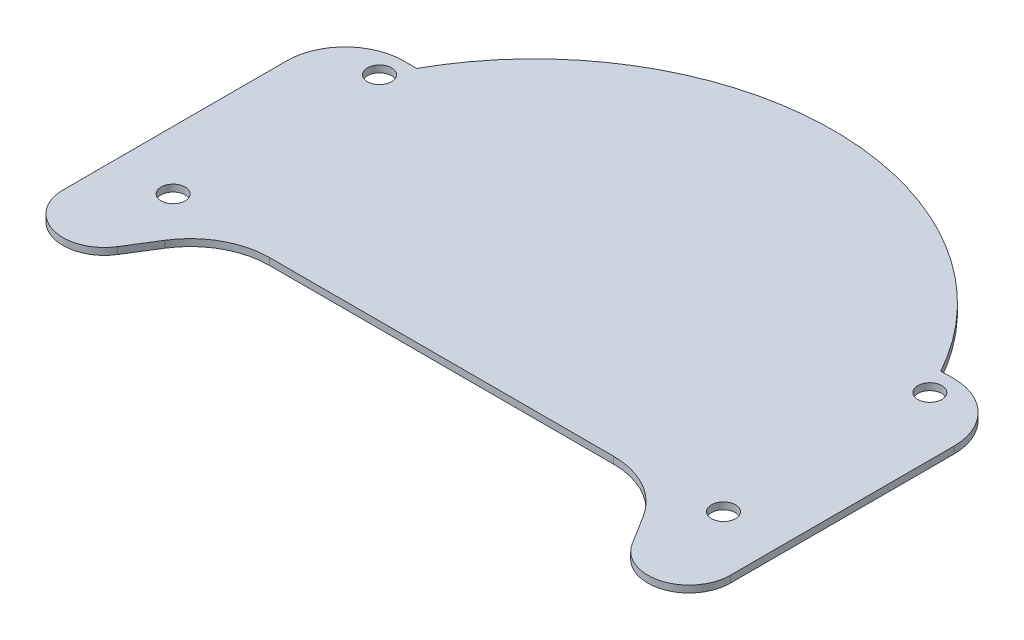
from build123d import *

# Parameters (mm, degrees)
CROQUIS9_R              = 3.5
SALIENTE_EXTRUIR1_DEPTH = 2


with BuildPart() as part:
    # Croquis9 → Saliente-Extruir1 (new body)
    with BuildSketch(Plane(origin=(0, 0, 0), x_dir=(1, 0, 0), z_dir=(0, 1, 0))):
        with BuildLine():
            Line((80, 72), (76.190550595, 72))
            ThreePointArc((76.190550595, 72), (0, 117), (-76.190550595, 72))
            Line((-76.190550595, 72), (-80, 72))
            ThreePointArc((-80, 72), (-92.02081528, 67.02081528), (-97, 55))
            Line((-97, 55), (-97, -10))
            ThreePointArc((-97, -10), (-88.296653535, -21.538287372), (-74.811320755, -16.339622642))
            Line((-74.811320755, -16.339622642), (-69.528301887, -7.849056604))
            ThreePointArc((-69.528301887, -7.849056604), (-61.169787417, 0.105617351), (-50, 3))
            Line((-50, 3), (50, 3))
            ThreePointArc((50, 3), (61.169787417, 0.105617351), (69.528301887, -7.849056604))
            Line((69.528301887, -7.849056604), (74.811320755, -16.339622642))
            ThreePointArc((74.811320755, -16.339622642), (88.296653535, -21.538287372), (97, -10))
            Line((97, -10), (97, 55))
            ThreePointArc((97, 55), (92.02081528, 67.02081528), (80, 72))
        make_face()
        with Locations(Location((-80, 65, 0), (0, 0, 270))):
            Circle(CROQUIS9_R, mode=Mode.SUBTRACT)
        with Locations(Location((80, 65, 0), (0, 0, 270))):
            Circle(CROQUIS9_R, mode=Mode.SUBTRACT)
        with Locations(Location((80, 5, 0), (0, 0, 270))):
            Circle(CROQUIS9_R, mode=Mode.SUBTRACT)
        with Locations(Location((-80, 5, 0), (0, 0, 270))):
            Circle(CROQUIS9_R, mode=Mode.SUBTRACT)
    extrude(amount=SALIENTE_EXTRUIR1_DEPTH)


solid = part.part
